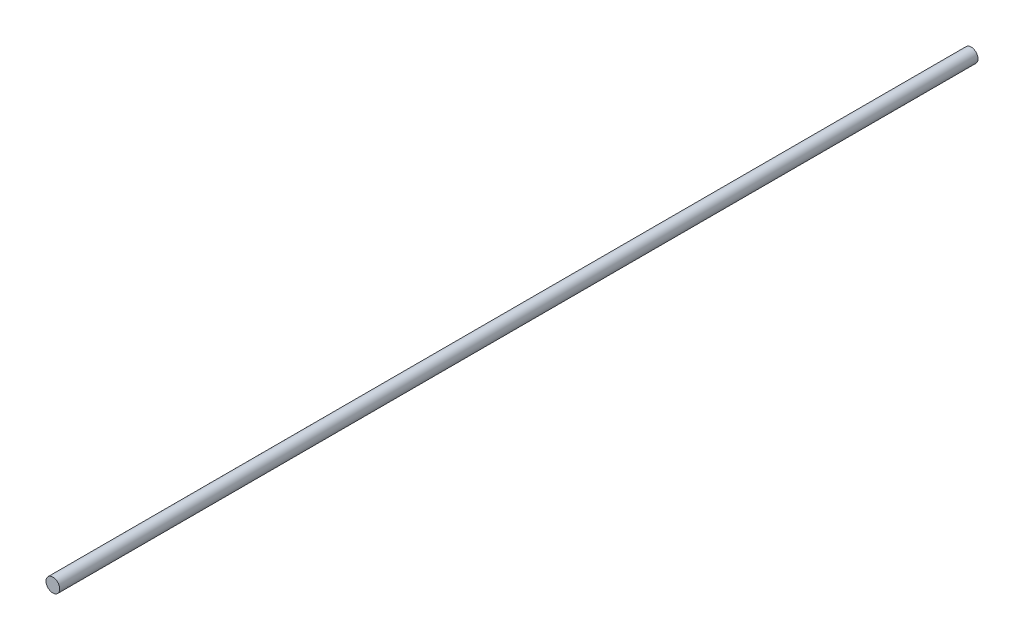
from build123d import *

# Parameters (mm, degrees)
SKETCH1_R           = 0.762
BOSS_EXTRUDE1_DEPTH = 101.6


with BuildPart() as part:
    # Sketch1 → Boss-Extrude1 (new body)
    with BuildSketch(Plane.XY):
        Circle(SKETCH1_R)
    extrude(amount=BOSS_EXTRUDE1_DEPTH)


solid = part.part
